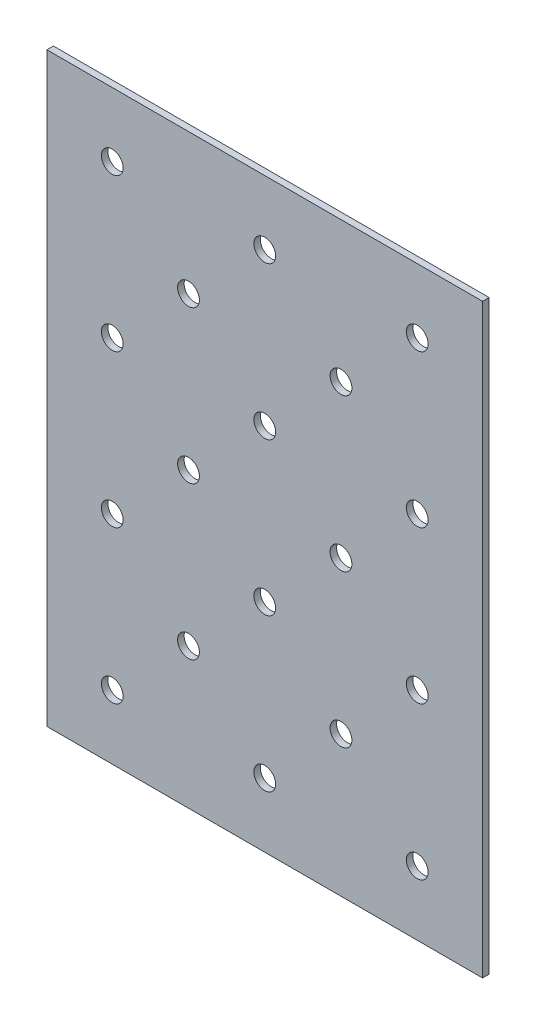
from build123d import *

# Parameters (mm, degrees)
ESQUISSE1_W             = 200
ESQUISSE1_H             = 269
BASE_EXTRUSION_DEPTH    = 3
ESQUISSE2_R             = 5
ENL_V_MAT_EXTRU_1_DEPTH = 3


with BuildPart() as part:
    # Esquisse1 → Base-Extrusion (new body)
    with BuildSketch(Plane.XY):
        with Locations((-84.313242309, 160)):
            Rectangle(ESQUISSE1_W, ESQUISSE1_H)
    extrude(amount=BASE_EXTRUSION_DEPTH)

    # Esquisse2 → Enl_v. mat.-Extru.1 (cut)
    with BuildSketch(Plane.XY.offset(3)):
        with Locations((-154.313242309, 265)):
            Circle(ESQUISSE2_R)
        with Locations((-84.313242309, 265)):
            Circle(ESQUISSE2_R)
        with Locations((-14.313242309, 265)):
            Circle(ESQUISSE2_R)
        with Locations((-119.313242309, 230)):
            Circle(ESQUISSE2_R)
        with Locations((-49.313242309, 230)):
            Circle(ESQUISSE2_R)
        with Locations((-154.313242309, 195)):
            Circle(ESQUISSE2_R)
        with Locations((-84.313242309, 195)):
            Circle(ESQUISSE2_R)
        with Locations((-14.313242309, 195)):
            Circle(ESQUISSE2_R)
        with Locations((-119.313242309, 160)):
            Circle(ESQUISSE2_R)
        with Locations((-49.313242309, 160)):
            Circle(ESQUISSE2_R)
        with Locations((-154.313242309, 125)):
            Circle(ESQUISSE2_R)
        with Locations((-84.313242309, 125)):
            Circle(ESQUISSE2_R)
        with Locations((-14.313242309, 125)):
            Circle(ESQUISSE2_R)
        with Locations((-119.313242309, 90)):
            Circle(ESQUISSE2_R)
        with Locations((-49.313242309, 90)):
            Circle(ESQUISSE2_R)
        with Locations((-154.313242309, 55)):
            Circle(ESQUISSE2_R)
        with Locations((-84.313242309, 55)):
            Circle(ESQUISSE2_R)
        with Locations((-14.313242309, 55)):
            Circle(ESQUISSE2_R)
    extrude(amount=-ENL_V_MAT_EXTRU_1_DEPTH, mode=Mode.SUBTRACT)


solid = part.part
